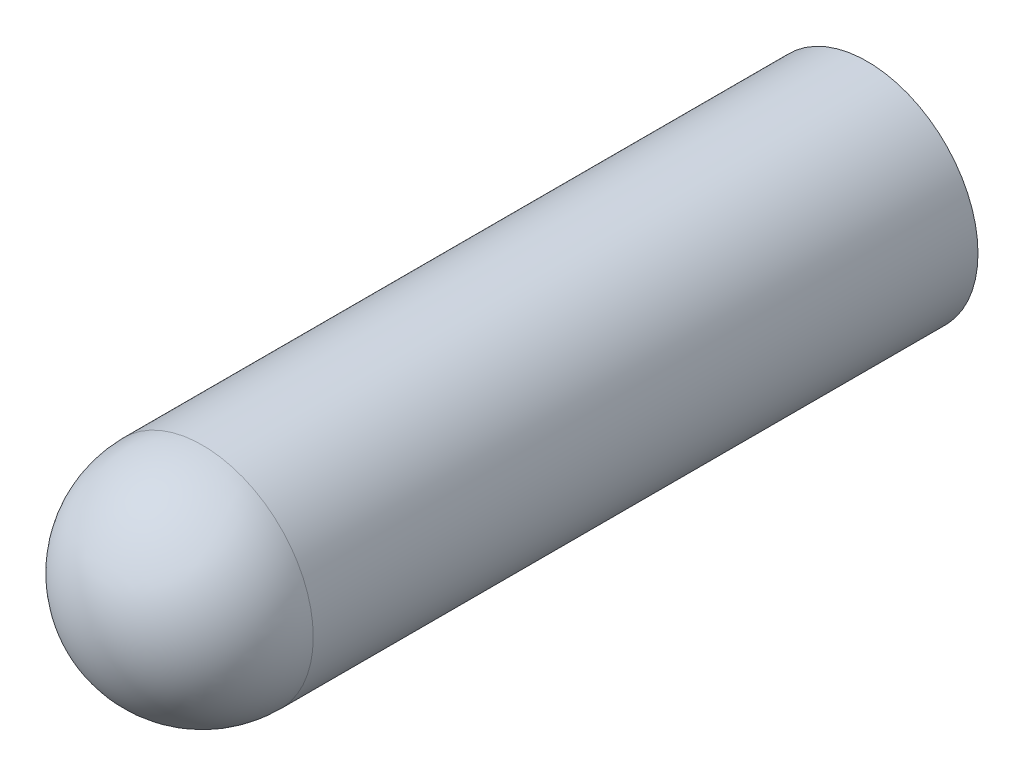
from build123d import *

# Parameters (mm, degrees)
SKETCH1_R           = 6.35
BOSS_EXTRUDE1_DEPTH = 38.1
REVOLVE1_ANGLE      = 180
SKETCH3_R           = 1.905
CUT_EXTRUDE1_DEPTH  = 25.4


with BuildPart() as part:
    # Sketch1 → Boss-Extrude1 (new body)
    with BuildSketch(Plane.XY):
        with Locations(Location((0, 0, 0), (0, 0, 180))):
            Circle(SKETCH1_R)
    extrude(amount=BOSS_EXTRUDE1_DEPTH)

    # Sketch2 → Revolve1 (revolve)
    with BuildSketch(Plane.XY.offset(38.1)):
        with BuildLine():
            Line((-6.35, 0), (6.35, 0))
            ThreePointArc((6.35, 0), (0, 6.35), (-6.35, 0))
        make_face()
    revolve(axis=Axis((-6.35, 0, 38.1), (1, 0, 0)), revolution_arc=REVOLVE1_ANGLE)

    # Sketch3 → Cut-Extrude1 (cut)
    with BuildSketch(Plane(origin=(0, 0, 0), x_dir=(-1, 0, 0), z_dir=(0, 0, -1))):
        Circle(SKETCH3_R)
    extrude(amount=-CUT_EXTRUDE1_DEPTH, mode=Mode.SUBTRACT)


solid = part.part
